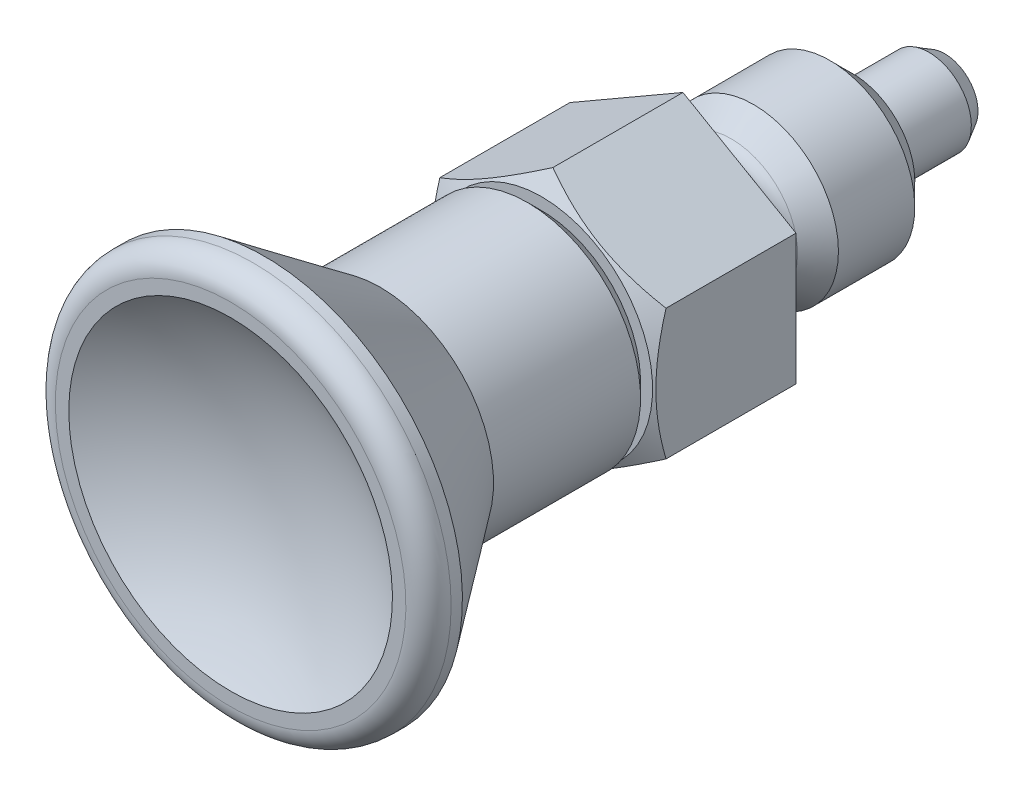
ISO-10303-21;
HEADER;
FILE_DESCRIPTION(('STEP AP214'),'2;1');
FILE_NAME('part.step','',(''),(''),'','','');
FILE_SCHEMA(('AUTOMOTIVE_DESIGN { 1 0 10303 214 1 1 1 1 }'));
ENDSEC;
DATA;
#1=APPLICATION_CONTEXT('core data for automotive mechanical design processes');
#2=APPLICATION_PROTOCOL_DEFINITION('international standard','automotive_design',2000,#1);
#3=PRODUCT_CONTEXT('',#1,'mechanical');
#4=PRODUCT('Part','Part','',(#3));
#5=PRODUCT_RELATED_PRODUCT_CATEGORY('part','',(#4));
#6=PRODUCT_DEFINITION_FORMATION('','',#4);
#7=PRODUCT_DEFINITION_CONTEXT('part definition',#1,'design');
#8=PRODUCT_DEFINITION('design','',#6,#7);
#9=PRODUCT_DEFINITION_SHAPE('','',#8);
#10=(LENGTH_UNIT() NAMED_UNIT(*) SI_UNIT(.MILLI.,.METRE.));
#11=(NAMED_UNIT(*) PLANE_ANGLE_UNIT() SI_UNIT($,.RADIAN.));
#12=(NAMED_UNIT(*) SI_UNIT($,.STERADIAN.) SOLID_ANGLE_UNIT());
#13=UNCERTAINTY_MEASURE_WITH_UNIT(LENGTH_MEASURE(1.E-05),#10,'distance_accuracy_value','');
#14=(GEOMETRIC_REPRESENTATION_CONTEXT(3) GLOBAL_UNCERTAINTY_ASSIGNED_CONTEXT((#13)) GLOBAL_UNIT_ASSIGNED_CONTEXT((#10,
#11,#12)) REPRESENTATION_CONTEXT('',''));
#15=CARTESIAN_POINT('',(0.,0.,0.));
#16=DIRECTION('',(0.,0.,1.));
#17=DIRECTION('',(1.,0.,0.));
#18=AXIS2_PLACEMENT_3D('',#15,#16,#17);
#19=CARTESIAN_POINT('',(0.,0.,-6.4999999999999));
#20=DIRECTION('',(-1.,0.,0.));
#21=DIRECTION('',(0.,1.,0.));
#22=AXIS2_PLACEMENT_3D('',#19,#20,#21);
#23=SPHERICAL_SURFACE('',#22,3.00000000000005);
#24=CARTESIAN_POINT('',(0.,0.,-9.25947486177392));
#25=DIRECTION('',(0.,0.,1.));
#26=DIRECTION('',(0.,-1.,0.));
#27=AXIS2_PLACEMENT_3D('',#24,#25,#26);
#28=CIRCLE('',#27,1.176987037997);
#29=CARTESIAN_POINT('',(0.,-1.176987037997,-9.25947486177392));
#30=VERTEX_POINT('',#29);
#31=EDGE_CURVE('E18',#30,#30,#28,.T.);
#32=ORIENTED_EDGE('',*,*,#31,.F.);
#33=EDGE_LOOP('',(#32));
#34=FACE_BOUND('',#33,.T.);
#35=ADVANCED_FACE('F14',(#34),#23,.T.);
#36=CARTESIAN_POINT('',(0.,0.,-8.700000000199));
#37=DIRECTION('',(0.,0.,1.));
#38=DIRECTION('',(0.,-1.,0.));
#39=AXIS2_PLACEMENT_3D('',#36,#37,#38);
#40=CONICAL_SURFACE('',#39,1.49999999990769,0.52359877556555);
#41=CARTESIAN_POINT('',(0.,0.,-8.7));
#42=DIRECTION('',(0.,0.,1.));
#43=DIRECTION('',(0.,-1.,0.));
#44=AXIS2_PLACEMENT_3D('',#41,#42,#43);
#45=CIRCLE('',#44,1.5);
#46=CARTESIAN_POINT('',(0.,-1.5,-8.7));
#47=VERTEX_POINT('',#46);
#48=EDGE_CURVE('E545',#47,#47,#45,.T.);
#49=ORIENTED_EDGE('',*,*,#48,.F.);
#50=EDGE_LOOP('',(#49));
#51=FACE_BOUND('',#50,.T.);
#52=ORIENTED_EDGE('',*,*,#31,.T.);
#53=EDGE_LOOP('',(#52));
#54=FACE_BOUND('',#53,.T.);
#55=ADVANCED_FACE('F177',(#51,#54),#40,.T.);
#56=CARTESIAN_POINT('',(0.,0.,-9.5));
#57=DIRECTION('',(0.,0.,1.));
#58=DIRECTION('',(0.,-1.,0.));
#59=AXIS2_PLACEMENT_3D('',#56,#57,#58);
#60=CYLINDRICAL_SURFACE('',#59,1.5);
#61=CARTESIAN_POINT('',(0.,0.,-6.));
#62=DIRECTION('',(0.,0.,1.));
#63=DIRECTION('',(0.,-1.,0.));
#64=AXIS2_PLACEMENT_3D('',#61,#62,#63);
#65=CIRCLE('',#64,1.5);
#66=CARTESIAN_POINT('',(0.,-1.5,-6.));
#67=VERTEX_POINT('',#66);
#68=EDGE_CURVE('E548',#67,#67,#65,.F.);
#69=ORIENTED_EDGE('',*,*,#68,.T.);
#70=EDGE_LOOP('',(#69));
#71=FACE_BOUND('',#70,.T.);
#72=ORIENTED_EDGE('',*,*,#48,.T.);
#73=EDGE_LOOP('',(#72));
#74=FACE_BOUND('',#73,.T.);
#75=ADVANCED_FACE('F174',(#71,#74),#60,.T.);
#76=CARTESIAN_POINT('',(2.2,0.,-6.));
#77=DIRECTION('',(0.,0.,1.));
#78=DIRECTION('',(0.,-1.,0.));
#79=AXIS2_PLACEMENT_3D('',#76,#77,#78);
#80=PLANE('',#79);
#81=CARTESIAN_POINT('',(0.,0.,-6.0000000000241));
#82=DIRECTION('',(0.,0.,1.));
#83=DIRECTION('',(0.,-1.,0.));
#84=AXIS2_PLACEMENT_3D('',#81,#82,#83);
#85=CIRCLE('',#84,2.19999999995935);
#86=CARTESIAN_POINT('',(0.,-2.19999999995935,-6.0000000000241));
#87=VERTEX_POINT('',#86);
#88=EDGE_CURVE('E537',#87,#87,#85,.T.);
#89=ORIENTED_EDGE('',*,*,#88,.F.);
#90=EDGE_LOOP('',(#89));
#91=FACE_BOUND('',#90,.T.);
#92=ORIENTED_EDGE('',*,*,#68,.F.);
#93=EDGE_LOOP('',(#92));
#94=FACE_BOUND('',#93,.T.);
#95=ADVANCED_FACE('F170',(#91,#94),#80,.F.);
#96=CARTESIAN_POINT('',(0.,0.,-5.20000000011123));
#97=DIRECTION('',(0.,0.,1.));
#98=DIRECTION('',(0.,-1.,0.));
#99=AXIS2_PLACEMENT_3D('',#96,#97,#98);
#100=CONICAL_SURFACE('',#99,2.99999999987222,0.785398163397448);
#101=CARTESIAN_POINT('',(0.,0.,-5.2));
#102=DIRECTION('',(0.,0.,1.));
#103=DIRECTION('',(0.,-1.,0.));
#104=AXIS2_PLACEMENT_3D('',#101,#102,#103);
#105=CIRCLE('',#104,3.);
#106=CARTESIAN_POINT('',(0.,-3.,-5.2));
#107=VERTEX_POINT('',#106);
#108=EDGE_CURVE('E532',#107,#107,#105,.T.);
#109=ORIENTED_EDGE('',*,*,#108,.F.);
#110=EDGE_LOOP('',(#109));
#111=FACE_BOUND('',#110,.T.);
#112=ORIENTED_EDGE('',*,*,#88,.T.);
#113=EDGE_LOOP('',(#112));
#114=FACE_BOUND('',#113,.T.);
#115=ADVANCED_FACE('F166',(#111,#114),#100,.T.);
#116=CARTESIAN_POINT('',(0.,0.,-6.));
#117=DIRECTION('',(0.,0.,1.));
#118=DIRECTION('',(0.,-1.,0.));
#119=AXIS2_PLACEMENT_3D('',#116,#117,#118);
#120=CYLINDRICAL_SURFACE('',#119,3.);
#121=CARTESIAN_POINT('',(0.,0.,-2.49999999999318));
#122=DIRECTION('',(0.,0.,-1.));
#123=DIRECTION('',(0.,1.,0.));
#124=AXIS2_PLACEMENT_3D('',#121,#122,#123);
#125=CIRCLE('',#124,2.99999999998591);
#126=CARTESIAN_POINT('',(0.,2.99999999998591,-2.49999999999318));
#127=VERTEX_POINT('',#126);
#128=EDGE_CURVE('E530',#127,#127,#125,.F.);
#129=ORIENTED_EDGE('',*,*,#128,.F.);
#130=EDGE_LOOP('',(#129));
#131=FACE_BOUND('',#130,.T.);
#132=ORIENTED_EDGE('',*,*,#108,.T.);
#133=EDGE_LOOP('',(#132));
#134=FACE_BOUND('',#133,.T.);
#135=ADVANCED_FACE('F162',(#131,#134),#120,.T.);
#136=CARTESIAN_POINT('',(0.,0.,-2.49999999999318));
#137=DIRECTION('',(0.,0.,-1.));
#138=DIRECTION('',(0.,1.,0.));
#139=AXIS2_PLACEMENT_3D('',#136,#137,#138);
#140=CONICAL_SURFACE('',#139,2.99999999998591,0.698131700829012);
#141=CARTESIAN_POINT('',(0.,0.,-1.71388755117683));
#142=DIRECTION('',(0.,0.,-1.));
#143=DIRECTION('',(0.,1.,0.));
#144=AXIS2_PLACEMENT_3D('',#141,#142,#143);
#145=CIRCLE('',#144,2.34037333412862);
#146=CARTESIAN_POINT('',(0.,2.34037333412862,-1.71388755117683));
#147=VERTEX_POINT('',#146);
#148=EDGE_CURVE('E149',#147,#147,#145,.T.);
#149=ORIENTED_EDGE('',*,*,#148,.T.);
#150=EDGE_LOOP('',(#149));
#151=FACE_BOUND('',#150,.T.);
#152=ORIENTED_EDGE('',*,*,#128,.T.);
#153=EDGE_LOOP('',(#152));
#154=FACE_BOUND('',#153,.T.);
#155=ADVANCED_FACE('F158',(#151,#154),#140,.T.);
#156=CARTESIAN_POINT('',(0.,0.,-1.32821498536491));
#157=DIRECTION('',(0.,0.,-1.));
#158=DIRECTION('',(0.,1.,0.));
#159=AXIS2_PLACEMENT_3D('',#156,#157,#158);
#160=TOROIDAL_SURFACE('',#159,2.8,0.6);
#161=CARTESIAN_POINT('',(0.,0.,-1.32821498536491));
#162=DIRECTION('',(0.,0.,1.));
#163=DIRECTION('',(0.,-1.,0.));
#164=AXIS2_PLACEMENT_3D('',#161,#162,#163);
#165=CIRCLE('',#164,2.2);
#166=CARTESIAN_POINT('',(0.,-2.2,-1.32821498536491));
#167=VERTEX_POINT('',#166);
#168=EDGE_CURVE('E136',#167,#167,#165,.T.);
#169=ORIENTED_EDGE('',*,*,#168,.F.);
#170=EDGE_LOOP('',(#169));
#171=FACE_BOUND('',#170,.T.);
#172=ORIENTED_EDGE('',*,*,#148,.F.);
#173=EDGE_LOOP('',(#172));
#174=FACE_BOUND('',#173,.T.);
#175=ADVANCED_FACE('F155',(#171,#174),#160,.F.);
#176=CARTESIAN_POINT('',(0.,0.,-6.));
#177=DIRECTION('',(0.,0.,1.));
#178=DIRECTION('',(0.,-1.,0.));
#179=AXIS2_PLACEMENT_3D('',#176,#177,#178);
#180=CYLINDRICAL_SURFACE('',#179,2.2);
#181=CARTESIAN_POINT('',(0.,0.,-0.6));
#182=DIRECTION('',(0.,0.,-1.));
#183=DIRECTION('',(0.,1.,0.));
#184=AXIS2_PLACEMENT_3D('',#181,#182,#183);
#185=CIRCLE('',#184,2.2);
#186=CARTESIAN_POINT('',(0.,2.2,-0.6));
#187=VERTEX_POINT('',#186);
#188=EDGE_CURVE('E133',#187,#187,#185,.T.);
#189=ORIENTED_EDGE('',*,*,#188,.T.);
#190=EDGE_LOOP('',(#189));
#191=FACE_BOUND('',#190,.T.);
#192=ORIENTED_EDGE('',*,*,#168,.T.);
#193=EDGE_LOOP('',(#192));
#194=FACE_BOUND('',#193,.T.);
#195=ADVANCED_FACE('F126',(#191,#194),#180,.T.);
#196=CARTESIAN_POINT('',(0.,0.,-0.6));
#197=DIRECTION('',(0.,0.,-1.));
#198=DIRECTION('',(0.,1.,0.));
#199=AXIS2_PLACEMENT_3D('',#196,#197,#198);
#200=TOROIDAL_SURFACE('',#199,2.8,0.6);
#201=CARTESIAN_POINT('',(0.,0.,0.));
#202=DIRECTION('',(0.,0.,-1.));
#203=DIRECTION('',(0.,1.,0.));
#204=AXIS2_PLACEMENT_3D('',#201,#202,#203);
#205=CIRCLE('',#204,2.8);
#206=CARTESIAN_POINT('',(0.,2.8,0.));
#207=VERTEX_POINT('',#206);
#208=EDGE_CURVE('E81',#207,#207,#205,.T.);
#209=ORIENTED_EDGE('',*,*,#208,.T.);
#210=EDGE_LOOP('',(#209));
#211=FACE_BOUND('',#210,.T.);
#212=ORIENTED_EDGE('',*,*,#188,.F.);
#213=EDGE_LOOP('',(#212));
#214=FACE_BOUND('',#213,.T.);
#215=ADVANCED_FACE('F119',(#211,#214),#200,.F.);
#216=CARTESIAN_POINT('',(13.,0.,0.));
#217=DIRECTION('',(0.,0.,1.));
#218=DIRECTION('',(0.,-1.,0.));
#219=AXIS2_PLACEMENT_3D('',#216,#217,#218);
#220=PLANE('',#219);
#221=DIRECTION('',(-0.866025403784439,0.5,0.));
#222=VECTOR('',#221,1.);
#223=CARTESIAN_POINT('',(4.,2.3094010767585,0.));
#224=LINE('',#223,#222);
#225=CARTESIAN_POINT('',(4.,2.3094010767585,0.));
#226=VERTEX_POINT('',#225);
#227=CARTESIAN_POINT('',(0.,4.61880215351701,0.));
#228=VERTEX_POINT('',#227);
#229=EDGE_CURVE('E88',#226,#228,#224,.T.);
#230=ORIENTED_EDGE('',*,*,#229,.F.);
#231=DIRECTION('',(0.,1.,0.));
#232=VECTOR('',#231,1.);
#233=CARTESIAN_POINT('',(4.,-2.3094010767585,0.));
#234=LINE('',#233,#232);
#235=CARTESIAN_POINT('',(4.,-2.3094010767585,0.));
#236=VERTEX_POINT('',#235);
#237=EDGE_CURVE('E84',#236,#226,#234,.T.);
#238=ORIENTED_EDGE('',*,*,#237,.F.);
#239=DIRECTION('',(0.866025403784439,0.5,0.));
#240=VECTOR('',#239,1.);
#241=CARTESIAN_POINT('',(0.,-4.61880215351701,0.));
#242=LINE('',#241,#240);
#243=CARTESIAN_POINT('',(0.,-4.61880215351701,0.));
#244=VERTEX_POINT('',#243);
#245=EDGE_CURVE('E60',#244,#236,#242,.T.);
#246=ORIENTED_EDGE('',*,*,#245,.F.);
#247=DIRECTION('',(0.866025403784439,-0.5,0.));
#248=VECTOR('',#247,1.);
#249=CARTESIAN_POINT('',(-4.,-2.3094010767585,0.));
#250=LINE('',#249,#248);
#251=CARTESIAN_POINT('',(-4.,-2.3094010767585,0.));
#252=VERTEX_POINT('',#251);
#253=EDGE_CURVE('E100',#252,#244,#250,.T.);
#254=ORIENTED_EDGE('',*,*,#253,.F.);
#255=DIRECTION('',(0.,-1.,0.));
#256=VECTOR('',#255,1.);
#257=CARTESIAN_POINT('',(-4.,2.3094010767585,0.));
#258=LINE('',#257,#256);
#259=CARTESIAN_POINT('',(-4.,2.3094010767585,0.));
#260=VERTEX_POINT('',#259);
#261=EDGE_CURVE('E65',#260,#252,#258,.T.);
#262=ORIENTED_EDGE('',*,*,#261,.F.);
#263=DIRECTION('',(-0.866025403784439,-0.5,0.));
#264=VECTOR('',#263,1.);
#265=CARTESIAN_POINT('',(0.,4.61880215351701,0.));
#266=LINE('',#265,#264);
#267=EDGE_CURVE('E266',#228,#260,#266,.T.);
#268=ORIENTED_EDGE('',*,*,#267,.F.);
#269=EDGE_LOOP('',(#230,#238,#246,#254,#262,#268));
#270=FACE_BOUND('',#269,.T.);
#271=ORIENTED_EDGE('',*,*,#208,.F.);
#272=EDGE_LOOP('',(#271));
#273=FACE_BOUND('',#272,.T.);
#274=ADVANCED_FACE('F85',(#270,#273),#220,.F.);
#275=CARTESIAN_POINT('',(0.,-4.61880215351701,0.));
#276=DIRECTION('',(0.5,-0.866025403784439,0.));
#277=DIRECTION('',(0.866025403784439,0.5,0.));
#278=AXIS2_PLACEMENT_3D('',#275,#276,#277);
#279=PLANE('',#278);
#280=ORIENTED_EDGE('',*,*,#245,.T.);
#281=DIRECTION('',(0.,0.,1.));
#282=VECTOR('',#281,1.);
#283=CARTESIAN_POINT('',(4.,-2.3094010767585,0.));
#284=LINE('',#283,#282);
#285=CARTESIAN_POINT('',(4.,-2.30940109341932,4.59999999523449));
#286=VERTEX_POINT('',#285);
#287=EDGE_CURVE('E77',#286,#236,#284,.F.);
#288=ORIENTED_EDGE('',*,*,#287,.F.);
#289=CARTESIAN_POINT('',(7.50195635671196E-08,-4.61880211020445,4.60000002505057));
#290=CARTESIAN_POINT('',(0.175775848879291,-4.51731791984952,4.65860893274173));
#291=CARTESIAN_POINT('',(0.353068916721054,-4.41495771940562,4.71191066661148));
#292=CARTESIAN_POINT('',(0.710724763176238,-4.20846502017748,4.80494724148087));
#293=CARTESIAN_POINT('',(0.89109389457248,-4.10432885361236,4.84464917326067));
#294=CARTESIAN_POINT('',(1.24959693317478,-3.89734702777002,4.9064480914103));
#295=CARTESIAN_POINT('',(1.42767569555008,-3.79453320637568,4.92895643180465));
#296=CARTESIAN_POINT('',(1.78467070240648,-3.58842204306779,4.95582166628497));
#297=CARTESIAN_POINT('',(1.96358565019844,-3.48512544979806,4.96020081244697));
#298=CARTESIAN_POINT('',(2.29786902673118,-3.29212685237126,4.95106741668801));
#299=CARTESIAN_POINT('',(2.45328761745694,-3.20239588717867,4.93979742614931));
#300=CARTESIAN_POINT('',(2.76311229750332,-3.0235185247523,4.90408539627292));
#301=CARTESIAN_POINT('',(2.9175173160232,-2.93437274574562,4.87963116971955));
#302=CARTESIAN_POINT('',(3.22798026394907,-2.75512687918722,4.81850033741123));
#303=CARTESIAN_POINT('',(3.38399891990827,-2.66504946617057,4.78156472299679));
#304=CARTESIAN_POINT('',(3.69370988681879,-2.4862377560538,4.69773649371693));
#305=CARTESIAN_POINT('',(3.84740616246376,-2.39750116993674,4.65086356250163));
#306=CARTESIAN_POINT('',(3.99999992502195,-2.3094011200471,4.60000002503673));
#307=B_SPLINE_CURVE_WITH_KNOTS('',3,(#289,#290,#291,#292,#293,#294,#295,#296,#297,#298,#299,
#300,#301,#302,#303,#304,#305,#306),.UNSPECIFIED.,.F.,.F.,(4,2,2,2,2,2,2,2,4),(0.,
0.634032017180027,1.26958762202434,1.88941519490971,2.50848175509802,3.04741550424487,
3.58684828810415,4.13824310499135,4.68855576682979),.UNSPECIFIED.);
#308=CARTESIAN_POINT('',(3.75097839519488E-08,-4.61880213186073,4.60000001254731));
#309=VERTEX_POINT('',#308);
#310=EDGE_CURVE('E52',#309,#286,#307,.T.);
#311=ORIENTED_EDGE('',*,*,#310,.F.);
#312=DIRECTION('',(0.,0.,1.));
#313=VECTOR('',#312,1.);
#314=CARTESIAN_POINT('',(0.,-4.61880215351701,0.));
#315=LINE('',#314,#313);
#316=EDGE_CURVE('E79',#244,#309,#315,.T.);
#317=ORIENTED_EDGE('',*,*,#316,.F.);
#318=EDGE_LOOP('',(#280,#288,#311,#317));
#319=FACE_BOUND('',#318,.T.);
#320=ADVANCED_FACE('F75',(#319),#279,.T.);
#321=CARTESIAN_POINT('',(4.,-2.3094010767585,0.));
#322=DIRECTION('',(1.,0.,0.));
#323=DIRECTION('',(0.,1.,0.));
#324=AXIS2_PLACEMENT_3D('',#321,#322,#323);
#325=PLANE('',#324);
#326=ORIENTED_EDGE('',*,*,#237,.T.);
#327=DIRECTION('',(0.,0.,1.));
#328=VECTOR('',#327,1.);
#329=CARTESIAN_POINT('',(4.,2.3094010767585,0.));
#330=LINE('',#329,#328);
#331=CARTESIAN_POINT('',(4.00000001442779,2.30940106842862,4.59999999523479));
#332=VERTEX_POINT('',#331);
#333=EDGE_CURVE('E91',#332,#226,#330,.F.);
#334=ORIENTED_EDGE('',*,*,#333,.F.);
#335=CARTESIAN_POINT('',(4.,-2.30940111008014,4.59999999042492));
#336=CARTESIAN_POINT('',(4.,-2.10643272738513,4.65860890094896));
#337=CARTESIAN_POINT('',(4.,-1.90171232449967,4.7119106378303));
#338=CARTESIAN_POINT('',(4.,-1.48872692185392,4.80494721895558));
#339=CARTESIAN_POINT('',(4.,-1.28045458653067,4.84464915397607));
#340=CARTESIAN_POINT('',(4.,-0.866490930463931,4.90644807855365));
#341=CARTESIAN_POINT('',(4.,-0.660863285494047,4.92895642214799));
#342=CARTESIAN_POINT('',(4.,-0.248640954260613,4.95582166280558));
#343=CARTESIAN_POINT('',(4.,-0.0420477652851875,4.96020081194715));
#344=CARTESIAN_POINT('',(4.,0.343949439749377,4.9510674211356));
#345=CARTESIAN_POINT('',(4.,0.52341137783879,4.93979743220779));
#346=CARTESIAN_POINT('',(4.,0.881166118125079,4.90408540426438));
#347=CARTESIAN_POINT('',(4.,1.05945768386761,4.87963117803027));
#348=CARTESIAN_POINT('',(4.,1.41794943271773,4.81850034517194));
#349=CARTESIAN_POINT('',(4.,1.59810426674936,4.78156472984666));
#350=CARTESIAN_POINT('',(4.,1.9557277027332,4.69773649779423));
#351=CARTESIAN_POINT('',(4.,2.13320088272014,4.65086356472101));
#352=CARTESIAN_POINT('',(4.,2.30940099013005,4.60000002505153));
#353=B_SPLINE_CURVE_WITH_KNOTS('',3,(#335,#336,#337,#338,#339,#340,#341,#342,#343,#344,#345,
#346,#347,#348,#349,#350,#351,#352),.UNSPECIFIED.,.F.,.F.,(4,2,2,2,2,2,2,2,4),(0.,
0.63403202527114,1.26958763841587,1.88941521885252,2.50848178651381,3.04741555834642,
3.58684836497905,4.13824320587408,4.688555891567),.UNSPECIFIED.);
#354=EDGE_CURVE('E95',#286,#332,#353,.T.);
#355=ORIENTED_EDGE('',*,*,#354,.F.);
#356=ORIENTED_EDGE('',*,*,#287,.T.);
#357=EDGE_LOOP('',(#326,#334,#355,#356));
#358=FACE_BOUND('',#357,.T.);
#359=ADVANCED_FACE('F93',(#358),#325,.T.);
#360=CARTESIAN_POINT('',(4.,2.3094010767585,0.));
#361=DIRECTION('',(0.5,0.866025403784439,0.));
#362=DIRECTION('',(-0.866025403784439,0.5,0.));
#363=AXIS2_PLACEMENT_3D('',#360,#361,#362);
#364=PLANE('',#363);
#365=ORIENTED_EDGE('',*,*,#229,.T.);
#366=DIRECTION('',(0.,0.,1.));
#367=VECTOR('',#366,1.);
#368=CARTESIAN_POINT('',(0.,4.61880215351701,0.));
#369=LINE('',#368,#367);
#370=CARTESIAN_POINT('',(-1.15300063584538E-08,4.61880214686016,4.60000000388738));
#371=VERTEX_POINT('',#370);
#372=EDGE_CURVE('E267',#371,#228,#369,.F.);
#373=ORIENTED_EDGE('',*,*,#372,.F.);
#374=CARTESIAN_POINT('',(4.00000002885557,2.30940106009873,4.59999999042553));
#375=CARTESIAN_POINT('',(3.8242242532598,2.41088525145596,4.65860890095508));
#376=CARTESIAN_POINT('',(3.64693118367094,2.51324545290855,4.71191063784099));
#377=CARTESIAN_POINT('',(3.28927533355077,2.71973815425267,4.80494721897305));
#378=CARTESIAN_POINT('',(3.10890620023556,2.8238743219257,4.8446491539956));
#379=CARTESIAN_POINT('',(2.75040315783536,3.03085614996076,4.90644807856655));
#380=CARTESIAN_POINT('',(2.57232439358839,3.13366997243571,4.92895642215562));
#381=CARTESIAN_POINT('',(2.21532938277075,3.33978113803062,4.95582166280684));
#382=CARTESIAN_POINT('',(2.03641443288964,3.44307773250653,4.96020081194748));
#383=CARTESIAN_POINT('',(1.70213104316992,3.63607633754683,4.95106742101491));
#384=CARTESIAN_POINT('',(1.54671244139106,3.72580730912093,4.93979743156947));
#385=CARTESIAN_POINT('',(1.23688773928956,3.90468468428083,4.9040854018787));
#386=CARTESIAN_POINT('',(1.08248270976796,3.99383046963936,4.87963117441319));
#387=CARTESIAN_POINT('',(0.772019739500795,4.17307634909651,4.81850033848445));
#388=CARTESIAN_POINT('',(0.61600107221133,4.26315376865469,4.78156472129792));
#389=CARTESIAN_POINT('',(0.30629008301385,4.44196549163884,4.69773648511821));
#390=CARTESIAN_POINT('',(0.152593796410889,4.53070208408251,4.65086354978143));
#391=CARTESIAN_POINT('',(2.30600062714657E-08,4.6188021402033,4.60000000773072));
#392=B_SPLINE_CURVE_WITH_KNOTS('',3,(#374,#375,#376,#377,#378,#379,#380,#381,#382,#383,#384,
#385,#386,#387,#388,#389,#390,#391),.UNSPECIFIED.,.F.,.F.,(4,2,2,2,2,2,2,2,4),(0.,
0.634032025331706,1.26958763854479,1.88941521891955,2.5084817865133,3.0474155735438,
3.58684839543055,4.13824325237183,4.68855595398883),.UNSPECIFIED.);
#393=EDGE_CURVE('E275',#332,#371,#392,.T.);
#394=ORIENTED_EDGE('',*,*,#393,.F.);
#395=ORIENTED_EDGE('',*,*,#333,.T.);
#396=EDGE_LOOP('',(#365,#373,#394,#395));
#397=FACE_BOUND('',#396,.T.);
#398=ADVANCED_FACE('F273',(#397),#364,.T.);
#399=CARTESIAN_POINT('',(0.,4.61880215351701,0.));
#400=DIRECTION('',(-0.5,0.866025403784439,0.));
#401=DIRECTION('',(-0.866025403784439,-0.5,0.));
#402=AXIS2_PLACEMENT_3D('',#399,#400,#401);
#403=PLANE('',#402);
#404=ORIENTED_EDGE('',*,*,#267,.T.);
#405=DIRECTION('',(0.,0.,1.));
#406=VECTOR('',#405,1.);
#407=CARTESIAN_POINT('',(-4.,2.3094010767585,0.));
#408=LINE('',#407,#406);
#409=CARTESIAN_POINT('',(-4.,2.30940109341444,4.5999999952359));
#410=VERTEX_POINT('',#409);
#411=EDGE_CURVE('E265',#410,#260,#408,.F.);
#412=ORIENTED_EDGE('',*,*,#411,.F.);
#413=CARTESIAN_POINT('',(-2.30600127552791E-08,4.61880214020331,4.60000000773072));
#414=CARTESIAN_POINT('',(-0.175775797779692,4.51731794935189,4.6586089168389));
#415=CARTESIAN_POINT('',(-0.353068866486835,4.41495774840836,4.71191065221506));
#416=CARTESIAN_POINT('',(-0.710724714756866,4.20846504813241,4.80494723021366));
#417=CARTESIAN_POINT('',(-0.891093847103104,4.10432888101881,4.84464916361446));
#418=CARTESIAN_POINT('',(-1.24959688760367,3.89734705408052,4.90644808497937));
#419=CARTESIAN_POINT('',(-1.42767565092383,3.79453323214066,4.92895642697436));
#420=CARTESIAN_POINT('',(-1.78467065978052,3.5884220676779,4.95582166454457));
#421=CARTESIAN_POINT('',(-1.9635856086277,3.48512547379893,4.96020081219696));
#422=CARTESIAN_POINT('',(-2.29786898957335,3.29212687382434,4.95106741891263));
#423=CARTESIAN_POINT('',(-2.45328758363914,3.20239590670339,4.93979742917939));
#424=CARTESIAN_POINT('',(-2.76311227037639,3.02351854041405,4.90408540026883));
#425=CARTESIAN_POINT('',(-2.91751729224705,2.93437275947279,4.87963117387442));
#426=CARTESIAN_POINT('',(-3.22798024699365,2.75512688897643,4.81850034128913));
#427=CARTESIAN_POINT('',(-3.38399890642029,2.66504947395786,4.78156472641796));
#428=CARTESIAN_POINT('',(-3.69370988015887,2.4862377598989,4.69773649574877));
#429=CARTESIAN_POINT('',(-3.84740615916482,2.39750117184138,4.65086356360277));
#430=CARTESIAN_POINT('',(-3.99999992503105,2.30940112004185,4.6000000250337));
#431=B_SPLINE_CURVE_WITH_KNOTS('',3,(#413,#414,#415,#416,#417,#418,#419,#420,#421,#422,#423,
#424,#425,#426,#427,#428,#429,#430),.UNSPECIFIED.,.F.,.F.,(4,2,2,2,2,2,2,2,4),(0.,
0.634032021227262,1.26958763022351,1.88941520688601,2.50848177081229,3.04741553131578,
3.58684832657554,4.13824315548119,4.68855582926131),.UNSPECIFIED.);
#432=EDGE_CURVE('E278',#371,#410,#431,.T.);
#433=ORIENTED_EDGE('',*,*,#432,.F.);
#434=ORIENTED_EDGE('',*,*,#372,.T.);
#435=EDGE_LOOP('',(#404,#412,#433,#434));
#436=FACE_BOUND('',#435,.T.);
#437=ADVANCED_FACE('F304',(#436),#403,.T.);
#438=CARTESIAN_POINT('',(-4.,2.3094010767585,0.));
#439=DIRECTION('',(-1.,0.,0.));
#440=DIRECTION('',(0.,-1.,0.));
#441=AXIS2_PLACEMENT_3D('',#438,#439,#440);
#442=PLANE('',#441);
#443=ORIENTED_EDGE('',*,*,#261,.T.);
#444=DIRECTION('',(0.,0.,1.));
#445=VECTOR('',#444,1.);
#446=CARTESIAN_POINT('',(-4.,-2.3094010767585,0.));
#447=LINE('',#446,#445);
#448=CARTESIAN_POINT('',(-4.00000001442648,-2.30940106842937,4.59999999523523));
#449=VERTEX_POINT('',#448);
#450=EDGE_CURVE('E33',#449,#252,#447,.F.);
#451=ORIENTED_EDGE('',*,*,#450,.F.);
#452=CARTESIAN_POINT('',(-4.,2.30940111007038,4.59999999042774));
#453=CARTESIAN_POINT('',(-4.,2.10643272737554,4.65860890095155));
#454=CARTESIAN_POINT('',(-4.,1.90171232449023,4.71191063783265));
#455=CARTESIAN_POINT('',(-4.,1.48872692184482,4.80494721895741));
#456=CARTESIAN_POINT('',(-4.,1.28045458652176,4.84464915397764));
#457=CARTESIAN_POINT('',(-4.,0.866490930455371,4.9064480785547));
#458=CARTESIAN_POINT('',(-4.,0.660863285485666,4.92895642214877));
#459=CARTESIAN_POINT('',(-4.,0.248640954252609,4.95582166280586));
#460=CARTESIAN_POINT('',(-4.,0.0420477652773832,4.96020081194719));
#461=CARTESIAN_POINT('',(-4.,-0.343949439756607,4.95106742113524));
#462=CARTESIAN_POINT('',(-4.,-0.523411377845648,4.93979743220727));
#463=CARTESIAN_POINT('',(-4.,-0.881166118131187,4.90408540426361));
#464=CARTESIAN_POINT('',(-4.,-1.05945768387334,4.87963117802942));
#465=CARTESIAN_POINT('',(-4.,-1.41794943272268,4.81850034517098));
#466=CARTESIAN_POINT('',(-4.,-1.59810426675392,4.78156472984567));
#467=CARTESIAN_POINT('',(-4.,-1.95572770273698,4.69773649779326));
#468=CARTESIAN_POINT('',(-4.,-2.13320088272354,4.65086356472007));
#469=CARTESIAN_POINT('',(-4.,-2.30940099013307,4.60000002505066));
#470=B_SPLINE_CURVE_WITH_KNOTS('',3,(#452,#453,#454,#455,#456,#457,#458,#459,#460,#461,#462,
#463,#464,#465,#466,#467,#468,#469),.UNSPECIFIED.,.F.,.F.,(4,2,2,2,2,2,2,2,4),(0.,
0.634032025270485,1.26958763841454,1.88941521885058,2.50848178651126,3.04741555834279,
3.58684836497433,4.13824320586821,4.68855589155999),.UNSPECIFIED.);
#471=EDGE_CURVE('E315',#410,#449,#470,.T.);
#472=ORIENTED_EDGE('',*,*,#471,.F.);
#473=ORIENTED_EDGE('',*,*,#411,.T.);
#474=EDGE_LOOP('',(#443,#451,#472,#473));
#475=FACE_BOUND('',#474,.T.);
#476=ADVANCED_FACE('F308',(#475),#442,.T.);
#477=CARTESIAN_POINT('',(-4.,-2.3094010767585,0.));
#478=DIRECTION('',(-0.5,-0.866025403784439,0.));
#479=DIRECTION('',(0.866025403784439,-0.5,0.));
#480=AXIS2_PLACEMENT_3D('',#477,#478,#479);
#481=PLANE('',#480);
#482=ORIENTED_EDGE('',*,*,#253,.T.);
#483=ORIENTED_EDGE('',*,*,#316,.T.);
#484=CARTESIAN_POINT('',(-4.00000002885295,-2.30940106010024,4.5999999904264));
#485=CARTESIAN_POINT('',(-3.82422425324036,-2.41088525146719,4.65860890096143));
#486=CARTESIAN_POINT('',(-3.64693118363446,-2.51324545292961,4.71191063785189));
#487=CARTESIAN_POINT('',(-3.28927533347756,-2.71973815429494,4.80494721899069));
#488=CARTESIAN_POINT('',(-3.10890620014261,-2.82387432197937,4.84464915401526));
#489=CARTESIAN_POINT('',(-2.75040315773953,-3.03085615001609,4.90644807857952));
#490=CARTESIAN_POINT('',(-2.57232439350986,-3.13366997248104,4.92895642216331));
#491=CARTESIAN_POINT('',(-2.21532938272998,-3.33978113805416,4.95582166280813));
#492=CARTESIAN_POINT('',(-2.03641443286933,-3.44307773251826,4.96020081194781));
#493=CARTESIAN_POINT('',(-1.70213103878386,-3.63607634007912,4.95106742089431));
#494=CARTESIAN_POINT('',(-1.54671243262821,-3.72580731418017,4.93979743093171));
#495=CARTESIAN_POINT('',(-1.23688772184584,-3.90468469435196,4.90408539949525));
#496=CARTESIAN_POINT('',(-1.08248268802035,-3.99383048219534,4.8796311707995));
#497=CARTESIAN_POINT('',(-0.77201970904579,-4.17307636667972,4.81850033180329));
#498=CARTESIAN_POINT('',(-0.616001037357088,-4.2631537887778,4.7815647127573));
#499=CARTESIAN_POINT('',(-0.306290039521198,-4.44196551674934,4.69773647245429));
#500=CARTESIAN_POINT('',(-0.152593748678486,-4.53070211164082,4.65086353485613));
#501=CARTESIAN_POINT('',(2.88526957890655E-08,-4.61880217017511,4.59999999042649));
#502=B_SPLINE_CURVE_WITH_KNOTS('',3,(#484,#485,#486,#487,#488,#489,#490,#491,#492,#493,#494,
#495,#496,#497,#498,#499,#500,#501),.UNSPECIFIED.,.F.,.F.,(4,2,2,2,2,2,2,2,4),(0.,
0.63403202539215,1.26958763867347,1.88941521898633,2.50848178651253,3.0474155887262,
3.58684842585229,4.13824329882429,4.68855601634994),.UNSPECIFIED.);
#503=EDGE_CURVE('E320',#449,#309,#502,.T.);
#504=ORIENTED_EDGE('',*,*,#503,.F.);
#505=ORIENTED_EDGE('',*,*,#450,.T.);
#506=EDGE_LOOP('',(#482,#483,#504,#505));
#507=FACE_BOUND('',#506,.T.);
#508=ADVANCED_FACE('F325',(#507),#481,.T.);
#509=CARTESIAN_POINT('',(0.,0.,4.59760000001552));
#510=DIRECTION('',(0.,0.,-1.));
#511=DIRECTION('',(0.,1.,0.));
#512=AXIS2_PLACEMENT_3D('',#509,#510,#511);
#513=CONICAL_SURFACE('',#512,4.6229590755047,1.0471975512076);
#514=CARTESIAN_POINT('',(0.,0.,5.));
#515=DIRECTION('',(0.,0.,-1.));
#516=DIRECTION('',(0.,1.,0.));
#517=AXIS2_PLACEMENT_3D('',#514,#515,#516);
#518=CIRCLE('',#517,3.92598183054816);
#519=CARTESIAN_POINT('',(0.,3.92598183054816,5.));
#520=VERTEX_POINT('',#519);
#521=EDGE_CURVE('E248',#520,#520,#518,.T.);
#522=ORIENTED_EDGE('',*,*,#521,.T.);
#523=EDGE_LOOP('',(#522));
#524=FACE_BOUND('',#523,.T.);
#525=ORIENTED_EDGE('',*,*,#471,.T.);
#526=ORIENTED_EDGE('',*,*,#503,.T.);
#527=ORIENTED_EDGE('',*,*,#310,.T.);
#528=ORIENTED_EDGE('',*,*,#354,.T.);
#529=ORIENTED_EDGE('',*,*,#393,.T.);
#530=ORIENTED_EDGE('',*,*,#432,.T.);
#531=EDGE_LOOP('',(#525,#526,#527,#528,#529,#530));
#532=FACE_BOUND('',#531,.T.);
#533=ADVANCED_FACE('F255',(#524,#532),#513,.T.);
#534=CARTESIAN_POINT('',(0.,0.,24.2));
#535=DIRECTION('',(-1.,0.,0.));
#536=DIRECTION('',(0.,1.,0.));
#537=AXIS2_PLACEMENT_3D('',#534,#535,#536);
#538=SPHERICAL_SURFACE('',#537,10.);
#539=CARTESIAN_POINT('',(0.,5.72363520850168,16.));
#540=CARTESIAN_POINT('',(-0.160807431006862,5.72363636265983,16.));
#541=CARTESIAN_POINT('',(-0.32159592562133,5.71685551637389,16.));
#542=CARTESIAN_POINT('',(-0.642083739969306,5.68977946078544,16.));
#543=CARTESIAN_POINT('',(-0.801782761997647,5.66948069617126,16.));
#544=CARTESIAN_POINT('',(-1.11904321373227,5.61548397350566,16.));
#545=CARTESIAN_POINT('',(-1.27660261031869,5.58177408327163,16.));
#546=CARTESIAN_POINT('',(-1.58837766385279,5.50118075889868,16.));
#547=CARTESIAN_POINT('',(-1.74259207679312,5.45429251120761,16.));
#548=CARTESIAN_POINT('',(-2.04639002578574,5.34772649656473,16.));
#549=CARTESIAN_POINT('',(-2.19597736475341,5.28805957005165,16.));
#550=CARTESIAN_POINT('',(-2.48964848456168,5.1563126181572,16.));
#551=CARTESIAN_POINT('',(-2.63373021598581,5.08422802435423,16.));
#552=CARTESIAN_POINT('',(-2.91521966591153,4.92822198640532,16.));
#553=CARTESIAN_POINT('',(-3.05263145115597,4.8443078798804,16.));
#554=CARTESIAN_POINT('',(-3.31994934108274,4.66517233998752,16.));
#555=CARTESIAN_POINT('',(-3.44985265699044,4.56994674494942,16.));
#556=CARTESIAN_POINT('',(-3.70114169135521,4.36891670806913,16.));
#557=CARTESIAN_POINT('',(-3.82252965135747,4.26311506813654,16.));
#558=CARTESIAN_POINT('',(-4.05600625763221,4.04162285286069,16.));
#559=CARTESIAN_POINT('',(-4.16809145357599,3.92592864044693,16.));
#560=CARTESIAN_POINT('',(-4.38207998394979,3.68554745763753,16.));
#561=CARTESIAN_POINT('',(-4.48398666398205,3.56086346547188,16.));
#562=CARTESIAN_POINT('',(-4.67697163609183,3.3033074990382,16.));
#563=CARTESIAN_POINT('',(-4.76804591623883,3.170432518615,16.));
#564=CARTESIAN_POINT('',(-4.93864148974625,2.89753415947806,16.));
#565=CARTESIAN_POINT('',(-5.01816724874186,2.75751357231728,16.));
#566=CARTESIAN_POINT('',(-5.16516989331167,2.47121903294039,16.));
#567=CARTESIAN_POINT('',(-5.23264231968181,2.3249427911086,16.));
#568=CARTESIAN_POINT('',(-5.35499943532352,2.02727986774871,16.));
#569=CARTESIAN_POINT('',(-5.40988878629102,1.87589510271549,16.));
#570=CARTESIAN_POINT('',(-5.50674021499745,1.5689867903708,16.));
#571=CARTESIAN_POINT('',(-5.54869751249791,1.41346173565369,16.));
#572=CARTESIAN_POINT('',(-5.61934383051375,1.09947530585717,16.));
#573=CARTESIAN_POINT('',(-5.64803771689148,0.941015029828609,16.));
#574=CARTESIAN_POINT('',(-5.69199213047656,0.62222618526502,16.));
#575=CARTESIAN_POINT('',(-5.70724769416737,0.461896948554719,16.));
#576=CARTESIAN_POINT('',(-5.73261157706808,-0.0200663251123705,16.));
#577=CARTESIAN_POINT('',(-5.72239370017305,-0.343017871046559,16.));
#578=CARTESIAN_POINT('',(-5.64788102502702,-0.982445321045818,16.));
#579=CARTESIAN_POINT('',(-5.5835862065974,-1.29892122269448,16.));
#580=CARTESIAN_POINT('',(-5.40277811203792,-1.91663457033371,16.));
#581=CARTESIAN_POINT('',(-5.28626478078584,-2.21787200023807,16.));
#582=CARTESIAN_POINT('',(-5.00431820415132,-2.79649753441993,16.));
#583=CARTESIAN_POINT('',(-4.83888497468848,-3.07388564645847,16.));
#584=CARTESIAN_POINT('',(-4.46379723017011,-3.59695416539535,16.));
#585=CARTESIAN_POINT('',(-4.25414273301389,-3.84263458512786,16.));
#586=CARTESIAN_POINT('',(-3.796563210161,-4.2953094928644,16.));
#587=CARTESIAN_POINT('',(-3.54863817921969,-4.50230397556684,16.));
#588=CARTESIAN_POINT('',(-3.02155560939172,-4.87173216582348,16.));
#589=CARTESIAN_POINT('',(-2.7423980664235,-5.03416586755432,16.));
#590=CARTESIAN_POINT('',(-2.16077492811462,-5.30986113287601,16.));
#591=CARTESIAN_POINT('',(-1.85830933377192,-5.42312269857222,16.));
#592=CARTESIAN_POINT('',(-1.23865621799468,-5.59725861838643,16.));
#593=CARTESIAN_POINT('',(-0.921468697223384,-5.65813297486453,16.));
#594=CARTESIAN_POINT('',(-0.281375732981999,-5.72576641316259,16.));
#595=CARTESIAN_POINT('',(0.0415297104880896,-5.73252549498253,16.));
#596=CARTESIAN_POINT('',(0.683892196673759,-5.69173654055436,16.));
#597=CARTESIAN_POINT('',(1.00334923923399,-5.64418850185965,16.));
#598=CARTESIAN_POINT('',(1.62974648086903,-5.49613496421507,16.));
#599=CARTESIAN_POINT('',(1.93668667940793,-5.39562946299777,16.));
#600=CARTESIAN_POINT('',(2.52933703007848,-5.14451437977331,16.));
#601=CARTESIAN_POINT('',(2.81504718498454,-4.99390480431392,16.));
#602=CARTESIAN_POINT('',(3.35712705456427,-4.64685580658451,16.));
#603=CARTESIAN_POINT('',(3.61349677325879,-4.4504163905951,16.));
#604=CARTESIAN_POINT('',(4.0896180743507,-4.01728823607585,16.));
#605=CARTESIAN_POINT('',(4.30936964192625,-3.78059948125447,16.));
#606=CARTESIAN_POINT('',(4.70601744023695,-3.27367551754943,16.));
#607=CARTESIAN_POINT('',(4.88291365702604,-3.00344029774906,16.));
#608=CARTESIAN_POINT('',(5.18882533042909,-2.43715468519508,16.));
#609=CARTESIAN_POINT('',(5.31784083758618,-2.14110431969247,16.));
#610=CARTESIAN_POINT('',(5.52434238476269,-1.53136936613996,16.));
#611=CARTESIAN_POINT('',(5.60182844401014,-1.21768478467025,16.));
#612=CARTESIAN_POINT('',(5.67775041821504,-0.741063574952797,16.));
#613=CARTESIAN_POINT('',(5.69633902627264,-0.581086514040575,16.));
#614=CARTESIAN_POINT('',(5.71997908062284,-0.26015121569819,16.));
#615=CARTESIAN_POINT('',(5.72503552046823,-0.0991933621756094,16.));
#616=CARTESIAN_POINT('',(5.72156943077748,0.22262392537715,16.));
#617=CARTESIAN_POINT('',(5.71304191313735,0.383483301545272,16.));
#618=CARTESIAN_POINT('',(5.68247012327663,0.703855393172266,16.));
#619=CARTESIAN_POINT('',(5.66043084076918,0.863368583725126,16.));
#620=CARTESIAN_POINT('',(5.60298439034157,1.18002989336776,16.));
#621=CARTESIAN_POINT('',(5.56757226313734,1.33717711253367,16.));
#622=CARTESIAN_POINT('',(5.48364862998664,1.64787176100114,16.));
#623=CARTESIAN_POINT('',(5.43514196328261,1.80142049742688,16.));
#624=CARTESIAN_POINT('',(5.32534671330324,2.10394548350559,16.));
#625=CARTESIAN_POINT('',(5.26405317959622,2.25291993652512,16.));
#626=CARTESIAN_POINT('',(5.12915652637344,2.54512049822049,16.));
#627=CARTESIAN_POINT('',(5.05555795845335,2.68834870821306,16.));
#628=CARTESIAN_POINT('',(4.89653218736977,2.96814329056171,16.));
#629=CARTESIAN_POINT('',(4.81110109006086,3.10470744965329,16.));
#630=CARTESIAN_POINT('',(4.62906996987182,3.37010300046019,16.));
#631=CARTESIAN_POINT('',(4.53247408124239,3.49893722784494,16.));
#632=CARTESIAN_POINT('',(4.32874747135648,3.74804508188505,16.));
#633=CARTESIAN_POINT('',(4.22161397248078,3.86831643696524,16.));
#634=CARTESIAN_POINT('',(3.9976367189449,4.09936315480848,16.));
#635=CARTESIAN_POINT('',(3.88079656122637,4.21014200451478,16.));
#636=CARTESIAN_POINT('',(3.63812684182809,4.42153169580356,16.));
#637=CARTESIAN_POINT('',(3.51229176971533,4.52213621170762,16.));
#638=CARTESIAN_POINT('',(3.25263946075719,4.71234836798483,16.));
#639=CARTESIAN_POINT('',(3.11882518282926,4.80196004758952,16.));
#640=CARTESIAN_POINT('',(2.84400709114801,4.96966373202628,16.));
#641=CARTESIAN_POINT('',(2.70299729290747,5.0477459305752,16.));
#642=CARTESIAN_POINT('',(2.41495020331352,5.19171760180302,16.));
#643=CARTESIAN_POINT('',(2.26791513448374,5.25761152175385,16.));
#644=CARTESIAN_POINT('',(1.96894533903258,5.37672030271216,16.));
#645=CARTESIAN_POINT('',(1.81701509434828,5.42994640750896,16.));
#646=CARTESIAN_POINT('',(1.50926303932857,5.52340348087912,16.));
#647=CARTESIAN_POINT('',(1.35344226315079,5.56363786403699,16.));
#648=CARTESIAN_POINT('',(0.999794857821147,5.63921310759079,16.));
#649=CARTESIAN_POINT('',(0.801164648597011,5.6708445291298,16.));
#650=CARTESIAN_POINT('',(0.401679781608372,5.7130548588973,16.));
#651=CARTESIAN_POINT('',(0.200825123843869,5.72363376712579,16.));
#652=CARTESIAN_POINT('',(0.,5.72363520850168,16.));
#653=B_SPLINE_CURVE_WITH_KNOTS('',3,(#539,#540,#541,#542,#543,#544,#545,#546,#547,#548,#549,
#550,#551,#552,#553,#554,#555,#556,#557,#558,#559,#560,#561,#562,#563,#564,#565,#566,#567,#568,
#569,#570,#571,#572,#573,#574,#575,#576,#577,#578,#579,#580,#581,#582,#583,#584,#585,#586,#587,
#588,#589,#590,#591,#592,#593,#594,#595,#596,#597,#598,#599,#600,#601,#602,#603,#604,#605,#606,
#607,#608,#609,#610,#611,#612,#613,#614,#615,#616,#617,#618,#619,#620,#621,#622,#623,#624,#625,
#626,#627,#628,#629,#630,#631,#632,#633,#634,#635,#636,#637,#638,#639,#640,#641,#642,#643,#644,
#645,#646,#647,#648,#649,#650,#651,#652),.UNSPECIFIED.,.T.,.F.,(4,2,2,2,2,2,2,2,2,2,2,2,2,2,2,2,
2,2,2,2,2,2,2,2,2,2,2,2,2,2,2,2,2,2,2,2,2,2,2,2,2,2,2,2,2,2,2,2,2,2,2,2,2,2,2,2,4),(0.,
0.482246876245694,0.964620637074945,1.44742454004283,1.93040502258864,2.41297739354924,
2.89572768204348,3.3781798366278,3.8608100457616,4.34331272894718,4.82599357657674,
5.30851524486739,5.79121506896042,6.27372774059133,6.75641855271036,7.23893025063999,
7.72162009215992,8.20413271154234,8.68682347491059,9.65116698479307,10.6155108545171,
11.5798557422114,12.5442003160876,13.5085444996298,14.4728888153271,15.4372332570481,
16.4015776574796,17.3659220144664,18.3302663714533,19.2946107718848,20.2589552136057,
21.2232995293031,22.1876437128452,23.1519882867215,24.1163331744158,25.0806770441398,
26.0450205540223,26.5277113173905,27.0102239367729,27.4929137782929,27.9754254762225,
28.4581162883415,28.9406289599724,29.4233287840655,29.9058504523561,30.3885312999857,
30.8710339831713,31.3536641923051,31.8361163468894,32.3188666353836,32.8014390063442,
33.28441948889,33.7672233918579,34.2495971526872,34.7318440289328,35.3341003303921,
35.9363566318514),.UNSPECIFIED.);
#654=CARTESIAN_POINT('',(0.,5.72363520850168,16.));
#655=VERTEX_POINT('',#654);
#656=EDGE_CURVE('E240',#655,#655,#653,.T.);
#657=ORIENTED_EDGE('',*,*,#656,.T.);
#658=EDGE_LOOP('',(#657));
#659=FACE_BOUND('',#658,.T.);
#660=ADVANCED_FACE('F250',(#659),#538,.F.);
#661=CARTESIAN_POINT('',(0.,0.,5.));
#662=DIRECTION('',(0.,0.,-1.));
#663=DIRECTION('',(0.,1.,0.));
#664=AXIS2_PLACEMENT_3D('',#661,#662,#663);
#665=PLANE('',#664);
#666=CARTESIAN_POINT('',(0.,0.,5.00000000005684));
#667=DIRECTION('',(0.,0.,1.));
#668=DIRECTION('',(0.,-1.,0.));
#669=AXIS2_PLACEMENT_3D('',#666,#667,#668);
#670=CIRCLE('',#669,3.49999999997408);
#671=CARTESIAN_POINT('',(0.,-3.49999999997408,5.00000000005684));
#672=VERTEX_POINT('',#671);
#673=EDGE_CURVE('E247',#672,#672,#670,.T.);
#674=ORIENTED_EDGE('',*,*,#673,.F.);
#675=EDGE_LOOP('',(#674));
#676=FACE_BOUND('',#675,.T.);
#677=ORIENTED_EDGE('',*,*,#521,.F.);
#678=EDGE_LOOP('',(#677));
#679=FACE_BOUND('',#678,.T.);
#680=ADVANCED_FACE('F235',(#676,#679),#665,.F.);
#681=CARTESIAN_POINT('',(5.72363520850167,0.,16.));
#682=DIRECTION('',(0.,0.,-1.));
#683=DIRECTION('',(0.,1.,0.));
#684=AXIS2_PLACEMENT_3D('',#681,#682,#683);
#685=PLANE('',#684);
#686=ORIENTED_EDGE('',*,*,#656,.F.);
#687=EDGE_LOOP('',(#686));
#688=FACE_BOUND('',#687,.T.);
#689=CARTESIAN_POINT('',(0.,0.,16.));
#690=DIRECTION('',(0.,0.,-1.));
#691=DIRECTION('',(0.,1.,0.));
#692=AXIS2_PLACEMENT_3D('',#689,#690,#691);
#693=CIRCLE('',#692,6.2);
#694=CARTESIAN_POINT('',(0.,6.2,16.));
#695=VERTEX_POINT('',#694);
#696=EDGE_CURVE('E222',#695,#695,#693,.T.);
#697=ORIENTED_EDGE('',*,*,#696,.F.);
#698=EDGE_LOOP('',(#697));
#699=FACE_BOUND('',#698,.T.);
#700=ADVANCED_FACE('F226',(#688,#699),#685,.F.);
#701=CARTESIAN_POINT('',(0.,0.,5.50000000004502));
#702=DIRECTION('',(0.,0.,1.));
#703=DIRECTION('',(0.,-1.,0.));
#704=AXIS2_PLACEMENT_3D('',#701,#702,#703);
#705=CONICAL_SURFACE('',#704,4.0000000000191,0.785398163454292);
#706=CARTESIAN_POINT('',(0.,0.,5.5));
#707=DIRECTION('',(0.,0.,1.));
#708=DIRECTION('',(0.,-1.,0.));
#709=AXIS2_PLACEMENT_3D('',#706,#707,#708);
#710=CIRCLE('',#709,4.);
#711=CARTESIAN_POINT('',(0.,-4.,5.5));
#712=VERTEX_POINT('',#711);
#713=EDGE_CURVE('E494',#712,#712,#710,.T.);
#714=ORIENTED_EDGE('',*,*,#713,.F.);
#715=EDGE_LOOP('',(#714));
#716=FACE_BOUND('',#715,.T.);
#717=ORIENTED_EDGE('',*,*,#673,.T.);
#718=EDGE_LOOP('',(#717));
#719=FACE_BOUND('',#718,.T.);
#720=ADVANCED_FACE('F209',(#716,#719),#705,.T.);
#721=CARTESIAN_POINT('',(0.,0.,15.2));
#722=DIRECTION('',(0.,0.,-1.));
#723=DIRECTION('',(0.,1.,0.));
#724=AXIS2_PLACEMENT_3D('',#721,#722,#723);
#725=TOROIDAL_SURFACE('',#724,6.2,0.8);
#726=CARTESIAN_POINT('',(0.,0.,15.2000000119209));
#727=DIRECTION('',(0.,0.,1.));
#728=DIRECTION('',(0.,-1.,0.));
#729=AXIS2_PLACEMENT_3D('',#726,#727,#728);
#730=CIRCLE('',#729,7.);
#731=CARTESIAN_POINT('',(0.,-7.,15.2000000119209));
#732=VERTEX_POINT('',#731);
#733=EDGE_CURVE('E498',#732,#732,#730,.F.);
#734=ORIENTED_EDGE('',*,*,#733,.F.);
#735=EDGE_LOOP('',(#734));
#736=FACE_BOUND('',#735,.T.);
#737=ORIENTED_EDGE('',*,*,#696,.T.);
#738=EDGE_LOOP('',(#737));
#739=FACE_BOUND('',#738,.T.);
#740=ADVANCED_FACE('F203',(#736,#739),#725,.T.);
#741=CARTESIAN_POINT('',(0.,0.,-9.5));
#742=DIRECTION('',(0.,0.,1.));
#743=DIRECTION('',(0.,-1.,0.));
#744=AXIS2_PLACEMENT_3D('',#741,#742,#743);
#745=CYLINDRICAL_SURFACE('',#744,4.);
#746=CARTESIAN_POINT('',(0.,0.,10.7010198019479));
#747=DIRECTION('',(0.,0.,1.));
#748=DIRECTION('',(0.,-1.,0.));
#749=AXIS2_PLACEMENT_3D('',#746,#747,#748);
#750=CIRCLE('',#749,4.);
#751=CARTESIAN_POINT('',(0.,-4.,10.7010198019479));
#752=VERTEX_POINT('',#751);
#753=EDGE_CURVE('E24',#752,#752,#750,.T.);
#754=ORIENTED_EDGE('',*,*,#753,.F.);
#755=EDGE_LOOP('',(#754));
#756=FACE_BOUND('',#755,.T.);
#757=ORIENTED_EDGE('',*,*,#713,.T.);
#758=EDGE_LOOP('',(#757));
#759=FACE_BOUND('',#758,.T.);
#760=ADVANCED_FACE('F196',(#756,#759),#745,.T.);
#761=CARTESIAN_POINT('',(0.,0.,-9.5));
#762=DIRECTION('',(0.,0.,1.));
#763=DIRECTION('',(0.,-1.,0.));
#764=AXIS2_PLACEMENT_3D('',#761,#762,#763);
#765=CYLINDRICAL_SURFACE('',#764,7.);
#766=ORIENTED_EDGE('',*,*,#733,.T.);
#767=EDGE_LOOP('',(#766));
#768=FACE_BOUND('',#767,.T.);
#769=CARTESIAN_POINT('',(0.,0.,14.8));
#770=DIRECTION('',(0.,0.,1.));
#771=DIRECTION('',(0.,-1.,0.));
#772=AXIS2_PLACEMENT_3D('',#769,#770,#771);
#773=CIRCLE('',#772,7.);
#774=CARTESIAN_POINT('',(0.,-7.,14.8));
#775=VERTEX_POINT('',#774);
#776=EDGE_CURVE('E9',#775,#775,#773,.F.);
#777=ORIENTED_EDGE('',*,*,#776,.F.);
#778=EDGE_LOOP('',(#777));
#779=FACE_BOUND('',#778,.T.);
#780=ADVANCED_FACE('F190',(#768,#779),#765,.T.);
#781=CARTESIAN_POINT('',(0.,0.,14.8));
#782=DIRECTION('',(0.,0.,1.));
#783=DIRECTION('',(-1.,0.,0.));
#784=AXIS2_PLACEMENT_3D('',#781,#782,#783);
#785=CONICAL_SURFACE('',#784,7.,0.631809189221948);
#786=ORIENTED_EDGE('',*,*,#776,.T.);
#787=EDGE_LOOP('',(#786));
#788=FACE_BOUND('',#787,.T.);
#789=ORIENTED_EDGE('',*,*,#753,.T.);
#790=EDGE_LOOP('',(#789));
#791=FACE_BOUND('',#790,.T.);
#792=ADVANCED_FACE('F188',(#788,#791),#785,.T.);
#793=CLOSED_SHELL('',(#35,#55,#75,#95,#115,#135,#155,#175,#195,#215,#274,#320,#359,#398,#437,
#476,#508,#533,#660,#680,#700,#720,#740,#760,#780,#792));
#794=MANIFOLD_SOLID_BREP('B1',#793);
#795=ADVANCED_BREP_SHAPE_REPRESENTATION('',(#18,#794),#14);
#796=SHAPE_DEFINITION_REPRESENTATION(#9,#795);
ENDSEC;
END-ISO-10303-21;
